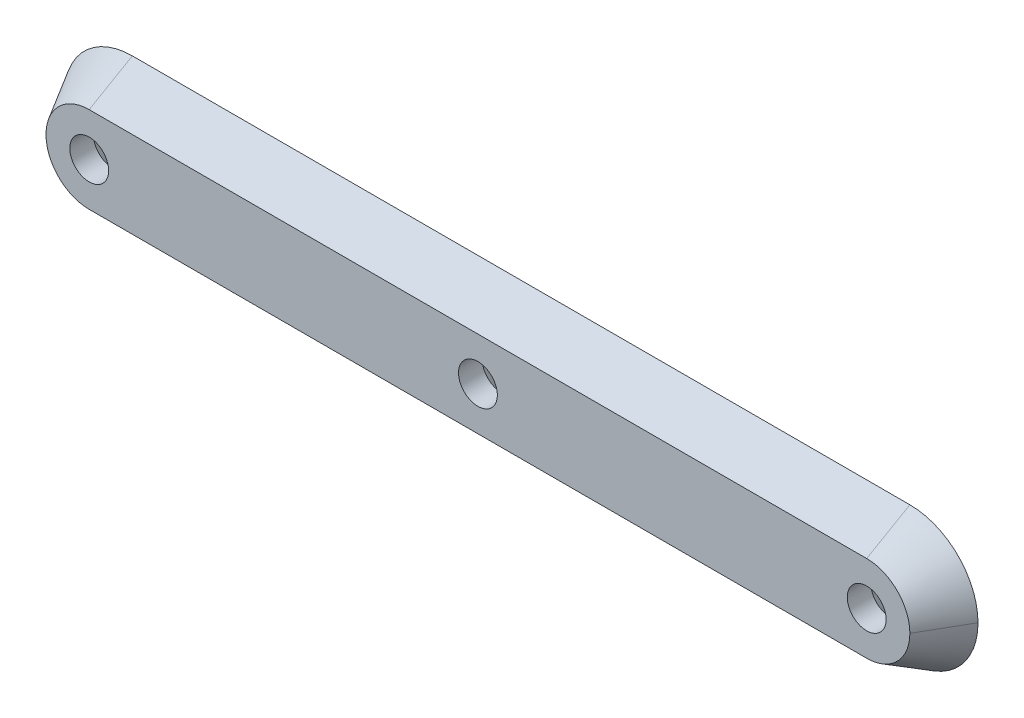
ISO-10303-21;
HEADER;
FILE_DESCRIPTION(('STEP AP214'),'2;1');
FILE_NAME('part.step','',(''),(''),'','','');
FILE_SCHEMA(('AUTOMOTIVE_DESIGN { 1 0 10303 214 1 1 1 1 }'));
ENDSEC;
DATA;
#1=APPLICATION_CONTEXT('core data for automotive mechanical design processes');
#2=APPLICATION_PROTOCOL_DEFINITION('international standard','automotive_design',2000,#1);
#3=PRODUCT_CONTEXT('',#1,'mechanical');
#4=PRODUCT('Part','Part','',(#3));
#5=PRODUCT_RELATED_PRODUCT_CATEGORY('part','',(#4));
#6=PRODUCT_DEFINITION_FORMATION('','',#4);
#7=PRODUCT_DEFINITION_CONTEXT('part definition',#1,'design');
#8=PRODUCT_DEFINITION('design','',#6,#7);
#9=PRODUCT_DEFINITION_SHAPE('','',#8);
#10=(LENGTH_UNIT() NAMED_UNIT(*) SI_UNIT(.MILLI.,.METRE.));
#11=(NAMED_UNIT(*) PLANE_ANGLE_UNIT() SI_UNIT($,.RADIAN.));
#12=(NAMED_UNIT(*) SI_UNIT($,.STERADIAN.) SOLID_ANGLE_UNIT());
#13=UNCERTAINTY_MEASURE_WITH_UNIT(LENGTH_MEASURE(1.E-05),#10,'distance_accuracy_value','');
#14=(GEOMETRIC_REPRESENTATION_CONTEXT(3) GLOBAL_UNCERTAINTY_ASSIGNED_CONTEXT((#13)) GLOBAL_UNIT_ASSIGNED_CONTEXT((#10,
#11,#12)) REPRESENTATION_CONTEXT('',''));
#15=CARTESIAN_POINT('',(0.,0.,0.));
#16=DIRECTION('',(0.,0.,1.));
#17=DIRECTION('',(1.,0.,0.));
#18=AXIS2_PLACEMENT_3D('',#15,#16,#17);
#19=CARTESIAN_POINT('',(50.0000000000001,-5.00000000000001,5.));
#20=DIRECTION('',(0.,-0.866025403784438,0.500000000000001));
#21=DIRECTION('',(0.,-0.500000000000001,-0.866025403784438));
#22=AXIS2_PLACEMENT_3D('',#19,#20,#21);
#23=PLANE('',#22);
#24=DIRECTION('',(-1.,0.,0.));
#25=VECTOR('',#24,1.);
#26=CARTESIAN_POINT('',(50.0000000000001,-7.88675134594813,0.));
#27=LINE('',#26,#25);
#28=CARTESIAN_POINT('',(-45.,-7.88675134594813,1.11022302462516E-13));
#29=VERTEX_POINT('',#28);
#30=CARTESIAN_POINT('',(45.0000000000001,-7.88675134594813,0.));
#31=VERTEX_POINT('',#30);
#32=EDGE_CURVE('E114',#29,#31,#27,.F.);
#33=ORIENTED_EDGE('',*,*,#32,.T.);
#34=DIRECTION('',(0.,-0.500000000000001,-0.866025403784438));
#35=VECTOR('',#34,1.);
#36=CARTESIAN_POINT('',(45.0000000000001,-5.00000000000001,5.));
#37=LINE('',#36,#35);
#38=CARTESIAN_POINT('',(45.0000000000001,-5.00000000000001,5.));
#39=VERTEX_POINT('',#38);
#40=EDGE_CURVE('E13',#31,#39,#37,.F.);
#41=ORIENTED_EDGE('',*,*,#40,.T.);
#42=DIRECTION('',(1.,0.,0.));
#43=VECTOR('',#42,1.);
#44=CARTESIAN_POINT('',(50.0000000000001,-5.00000000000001,5.));
#45=LINE('',#44,#43);
#46=CARTESIAN_POINT('',(-45.,-5.00000000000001,5.00000000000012));
#47=VERTEX_POINT('',#46);
#48=EDGE_CURVE('E113',#47,#39,#45,.T.);
#49=ORIENTED_EDGE('',*,*,#48,.F.);
#50=DIRECTION('',(0.,-0.500000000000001,-0.866025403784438));
#51=VECTOR('',#50,1.);
#52=CARTESIAN_POINT('',(-45.,-5.00000000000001,5.00000000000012));
#53=LINE('',#52,#51);
#54=EDGE_CURVE('E54',#47,#29,#53,.T.);
#55=ORIENTED_EDGE('',*,*,#54,.T.);
#56=EDGE_LOOP('',(#33,#41,#49,#55));
#57=FACE_BOUND('',#56,.T.);
#58=ADVANCED_FACE('F44',(#57),#23,.T.);
#59=CARTESIAN_POINT('',(50.0000000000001,5.,5.));
#60=DIRECTION('',(0.,0.866025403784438,0.500000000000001));
#61=DIRECTION('',(0.,-0.500000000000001,0.866025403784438));
#62=AXIS2_PLACEMENT_3D('',#59,#60,#61);
#63=PLANE('',#62);
#64=DIRECTION('',(-1.,0.,0.));
#65=VECTOR('',#64,1.);
#66=CARTESIAN_POINT('',(50.0000000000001,5.,5.));
#67=LINE('',#66,#65);
#68=CARTESIAN_POINT('',(45.0000000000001,5.00000000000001,5.));
#69=VERTEX_POINT('',#68);
#70=CARTESIAN_POINT('',(-45.,5.,5.00000000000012));
#71=VERTEX_POINT('',#70);
#72=EDGE_CURVE('E110',#69,#71,#67,.T.);
#73=ORIENTED_EDGE('',*,*,#72,.F.);
#74=DIRECTION('',(0.,0.500000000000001,-0.866025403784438));
#75=VECTOR('',#74,1.);
#76=CARTESIAN_POINT('',(45.0000000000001,5.00000000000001,5.));
#77=LINE('',#76,#75);
#78=CARTESIAN_POINT('',(45.0000000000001,7.88675134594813,0.));
#79=VERTEX_POINT('',#78);
#80=EDGE_CURVE('E98',#69,#79,#77,.T.);
#81=ORIENTED_EDGE('',*,*,#80,.T.);
#82=DIRECTION('',(1.,0.,0.));
#83=VECTOR('',#82,1.);
#84=CARTESIAN_POINT('',(50.0000000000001,7.88675134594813,0.));
#85=LINE('',#84,#83);
#86=CARTESIAN_POINT('',(-45.,7.88675134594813,1.11022302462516E-13));
#87=VERTEX_POINT('',#86);
#88=EDGE_CURVE('E107',#79,#87,#85,.F.);
#89=ORIENTED_EDGE('',*,*,#88,.T.);
#90=DIRECTION('',(0.,0.500000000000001,-0.866025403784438));
#91=VECTOR('',#90,1.);
#92=CARTESIAN_POINT('',(-45.,5.,5.00000000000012));
#93=LINE('',#92,#91);
#94=EDGE_CURVE('E48',#87,#71,#93,.F.);
#95=ORIENTED_EDGE('',*,*,#94,.T.);
#96=EDGE_LOOP('',(#73,#81,#89,#95));
#97=FACE_BOUND('',#96,.T.);
#98=ADVANCED_FACE('F46',(#97),#63,.T.);
#99=CARTESIAN_POINT('',(0.,0.,5.));
#100=DIRECTION('',(0.,0.,1.));
#101=DIRECTION('',(1.,0.,0.));
#102=AXIS2_PLACEMENT_3D('',#99,#100,#101);
#103=PLANE('',#102);
#104=CARTESIAN_POINT('',(-45.,0.,5.));
#105=DIRECTION('',(0.,0.,-1.));
#106=DIRECTION('',(-1.,0.,0.));
#107=AXIS2_PLACEMENT_3D('',#104,#105,#106);
#108=CIRCLE('',#107,2.2479);
#109=CARTESIAN_POINT('',(-47.2479,0.,5.));
#110=VERTEX_POINT('',#109);
#111=EDGE_CURVE('E157',#110,#110,#108,.T.);
#112=ORIENTED_EDGE('',*,*,#111,.T.);
#113=EDGE_LOOP('',(#112));
#114=FACE_BOUND('',#113,.T.);
#115=CARTESIAN_POINT('',(45.0000000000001,0.,4.99999999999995));
#116=DIRECTION('',(0.,0.,-1.));
#117=DIRECTION('',(-1.,0.,0.));
#118=AXIS2_PLACEMENT_3D('',#115,#116,#117);
#119=CIRCLE('',#118,2.2479);
#120=CARTESIAN_POINT('',(42.7521000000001,0.,4.99999999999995));
#121=VERTEX_POINT('',#120);
#122=EDGE_CURVE('E148',#121,#121,#119,.T.);
#123=ORIENTED_EDGE('',*,*,#122,.T.);
#124=EDGE_LOOP('',(#123));
#125=FACE_BOUND('',#124,.T.);
#126=CARTESIAN_POINT('',(0.,0.,5.));
#127=DIRECTION('',(0.,0.,-1.));
#128=DIRECTION('',(-1.,0.,0.));
#129=AXIS2_PLACEMENT_3D('',#126,#127,#128);
#130=CIRCLE('',#129,2.2479);
#131=CARTESIAN_POINT('',(-2.24789999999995,0.,5.));
#132=VERTEX_POINT('',#131);
#133=EDGE_CURVE('E127',#132,#132,#130,.T.);
#134=ORIENTED_EDGE('',*,*,#133,.T.);
#135=EDGE_LOOP('',(#134));
#136=FACE_BOUND('',#135,.T.);
#137=CARTESIAN_POINT('',(45.0000000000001,0.,4.99999999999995));
#138=DIRECTION('',(0.,0.,1.));
#139=DIRECTION('',(1.,0.,0.));
#140=AXIS2_PLACEMENT_3D('',#137,#138,#139);
#141=CIRCLE('',#140,5.);
#142=CARTESIAN_POINT('',(50.0000000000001,0.,5.));
#143=VERTEX_POINT('',#142);
#144=EDGE_CURVE('E62',#39,#143,#141,.T.);
#145=ORIENTED_EDGE('',*,*,#144,.T.);
#146=CARTESIAN_POINT('',(45.0000000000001,0.,4.99999999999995));
#147=DIRECTION('',(0.,0.,1.));
#148=DIRECTION('',(1.,0.,0.));
#149=AXIS2_PLACEMENT_3D('',#146,#147,#148);
#150=CIRCLE('',#149,5.);
#151=EDGE_CURVE('E129',#143,#69,#150,.T.);
#152=ORIENTED_EDGE('',*,*,#151,.T.);
#153=ORIENTED_EDGE('',*,*,#72,.T.);
#154=CARTESIAN_POINT('',(-45.,0.,5.));
#155=DIRECTION('',(0.,0.,1.));
#156=DIRECTION('',(1.,0.,0.));
#157=AXIS2_PLACEMENT_3D('',#154,#155,#156);
#158=CIRCLE('',#157,5.);
#159=CARTESIAN_POINT('',(-50.,0.,5.));
#160=VERTEX_POINT('',#159);
#161=EDGE_CURVE('E101',#71,#160,#158,.T.);
#162=ORIENTED_EDGE('',*,*,#161,.T.);
#163=CARTESIAN_POINT('',(-45.,0.,5.));
#164=DIRECTION('',(0.,0.,1.));
#165=DIRECTION('',(1.,0.,0.));
#166=AXIS2_PLACEMENT_3D('',#163,#164,#165);
#167=CIRCLE('',#166,5.);
#168=EDGE_CURVE('E134',#160,#47,#167,.T.);
#169=ORIENTED_EDGE('',*,*,#168,.T.);
#170=ORIENTED_EDGE('',*,*,#48,.T.);
#171=EDGE_LOOP('',(#145,#152,#153,#162,#169,#170));
#172=FACE_BOUND('',#171,.T.);
#173=ADVANCED_FACE('F172',(#114,#125,#136,#172),#103,.T.);
#174=CARTESIAN_POINT('',(0.,0.,0.));
#175=DIRECTION('',(0.,0.,1.));
#176=DIRECTION('',(1.,0.,0.));
#177=AXIS2_PLACEMENT_3D('',#174,#175,#176);
#178=PLANE('',#177);
#179=CARTESIAN_POINT('',(-45.,0.,0.));
#180=DIRECTION('',(0.,0.,-1.));
#181=DIRECTION('',(-1.,0.,0.));
#182=AXIS2_PLACEMENT_3D('',#179,#180,#181);
#183=CIRCLE('',#182,4.2164);
#184=CARTESIAN_POINT('',(-49.2164,0.,0.));
#185=VERTEX_POINT('',#184);
#186=EDGE_CURVE('E163',#185,#185,#183,.T.);
#187=ORIENTED_EDGE('',*,*,#186,.F.);
#188=EDGE_LOOP('',(#187));
#189=FACE_BOUND('',#188,.T.);
#190=CARTESIAN_POINT('',(45.0000000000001,0.,0.));
#191=DIRECTION('',(0.,0.,-1.));
#192=DIRECTION('',(-1.,0.,0.));
#193=AXIS2_PLACEMENT_3D('',#190,#191,#192);
#194=CIRCLE('',#193,4.2164);
#195=CARTESIAN_POINT('',(40.7836000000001,0.,0.));
#196=VERTEX_POINT('',#195);
#197=EDGE_CURVE('E154',#196,#196,#194,.T.);
#198=ORIENTED_EDGE('',*,*,#197,.F.);
#199=EDGE_LOOP('',(#198));
#200=FACE_BOUND('',#199,.T.);
#201=CARTESIAN_POINT('',(0.,0.,0.));
#202=DIRECTION('',(0.,0.,-1.));
#203=DIRECTION('',(-1.,0.,0.));
#204=AXIS2_PLACEMENT_3D('',#201,#202,#203);
#205=CIRCLE('',#204,4.2164);
#206=CARTESIAN_POINT('',(-4.2164,0.,0.));
#207=VERTEX_POINT('',#206);
#208=EDGE_CURVE('E145',#207,#207,#205,.T.);
#209=ORIENTED_EDGE('',*,*,#208,.F.);
#210=EDGE_LOOP('',(#209));
#211=FACE_BOUND('',#210,.T.);
#212=ORIENTED_EDGE('',*,*,#88,.F.);
#213=CARTESIAN_POINT('',(45.0000000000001,0.,0.));
#214=DIRECTION('',(0.,0.,1.));
#215=DIRECTION('',(1.,0.,0.));
#216=AXIS2_PLACEMENT_3D('',#213,#214,#215);
#217=CIRCLE('',#216,7.88675134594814);
#218=CARTESIAN_POINT('',(52.8867513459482,0.,0.));
#219=VERTEX_POINT('',#218);
#220=EDGE_CURVE('E94',#79,#219,#217,.F.);
#221=ORIENTED_EDGE('',*,*,#220,.T.);
#222=CARTESIAN_POINT('',(45.0000000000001,0.,0.));
#223=DIRECTION('',(0.,0.,1.));
#224=DIRECTION('',(1.,0.,0.));
#225=AXIS2_PLACEMENT_3D('',#222,#223,#224);
#226=CIRCLE('',#225,7.88675134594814);
#227=EDGE_CURVE('E102',#219,#31,#226,.F.);
#228=ORIENTED_EDGE('',*,*,#227,.T.);
#229=ORIENTED_EDGE('',*,*,#32,.F.);
#230=CARTESIAN_POINT('',(-45.,0.,0.));
#231=DIRECTION('',(0.,0.,1.));
#232=DIRECTION('',(1.,0.,0.));
#233=AXIS2_PLACEMENT_3D('',#230,#231,#232);
#234=CIRCLE('',#233,7.88675134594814);
#235=CARTESIAN_POINT('',(-52.8867513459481,0.,0.));
#236=VERTEX_POINT('',#235);
#237=EDGE_CURVE('E121',#29,#236,#234,.F.);
#238=ORIENTED_EDGE('',*,*,#237,.T.);
#239=CARTESIAN_POINT('',(-45.,0.,0.));
#240=DIRECTION('',(0.,0.,1.));
#241=DIRECTION('',(1.,0.,0.));
#242=AXIS2_PLACEMENT_3D('',#239,#240,#241);
#243=CIRCLE('',#242,7.88675134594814);
#244=EDGE_CURVE('E87',#236,#87,#243,.F.);
#245=ORIENTED_EDGE('',*,*,#244,.T.);
#246=EDGE_LOOP('',(#212,#221,#228,#229,#238,#245));
#247=FACE_BOUND('',#246,.T.);
#248=ADVANCED_FACE('F112',(#189,#200,#211,#247),#178,.F.);
#249=CARTESIAN_POINT('',(45.0000000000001,0.,4.99999999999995));
#250=DIRECTION('',(0.,0.,-1.));
#251=DIRECTION('',(1.,0.,0.));
#252=AXIS2_PLACEMENT_3D('',#249,#250,#251);
#253=CONICAL_SURFACE('',#252,5.,0.5235987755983);
#254=DIRECTION('',(0.500000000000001,0.,-0.866025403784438));
#255=VECTOR('',#254,1.);
#256=CARTESIAN_POINT('',(50.0000000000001,0.,5.));
#257=LINE('',#256,#255);
#258=EDGE_CURVE('E99',#143,#219,#257,.T.);
#259=ORIENTED_EDGE('',*,*,#258,.F.);
#260=ORIENTED_EDGE('',*,*,#144,.F.);
#261=ORIENTED_EDGE('',*,*,#40,.F.);
#262=ORIENTED_EDGE('',*,*,#227,.F.);
#263=EDGE_LOOP('',(#259,#260,#261,#262));
#264=FACE_BOUND('',#263,.T.);
#265=ADVANCED_FACE('F171',(#264),#253,.T.);
#266=CARTESIAN_POINT('',(45.0000000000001,0.,4.99999999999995));
#267=DIRECTION('',(0.,0.,-1.));
#268=DIRECTION('',(1.,0.,0.));
#269=AXIS2_PLACEMENT_3D('',#266,#267,#268);
#270=CONICAL_SURFACE('',#269,5.,0.5235987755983);
#271=ORIENTED_EDGE('',*,*,#151,.F.);
#272=ORIENTED_EDGE('',*,*,#258,.T.);
#273=ORIENTED_EDGE('',*,*,#220,.F.);
#274=ORIENTED_EDGE('',*,*,#80,.F.);
#275=EDGE_LOOP('',(#271,#272,#273,#274));
#276=FACE_BOUND('',#275,.T.);
#277=ADVANCED_FACE('F97',(#276),#270,.T.);
#278=CARTESIAN_POINT('',(-45.,0.,5.));
#279=DIRECTION('',(0.,0.,-1.));
#280=DIRECTION('',(1.,0.,0.));
#281=AXIS2_PLACEMENT_3D('',#278,#279,#280);
#282=CONICAL_SURFACE('',#281,5.,0.5235987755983);
#283=DIRECTION('',(-0.500000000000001,0.,-0.866025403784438));
#284=VECTOR('',#283,1.);
#285=CARTESIAN_POINT('',(-50.,0.,5.));
#286=LINE('',#285,#284);
#287=EDGE_CURVE('E124',#160,#236,#286,.T.);
#288=ORIENTED_EDGE('',*,*,#287,.F.);
#289=ORIENTED_EDGE('',*,*,#161,.F.);
#290=ORIENTED_EDGE('',*,*,#94,.F.);
#291=ORIENTED_EDGE('',*,*,#244,.F.);
#292=EDGE_LOOP('',(#288,#289,#290,#291));
#293=FACE_BOUND('',#292,.T.);
#294=ADVANCED_FACE('F203',(#293),#282,.T.);
#295=CARTESIAN_POINT('',(-45.,0.,5.));
#296=DIRECTION('',(0.,0.,-1.));
#297=DIRECTION('',(1.,0.,0.));
#298=AXIS2_PLACEMENT_3D('',#295,#296,#297);
#299=CONICAL_SURFACE('',#298,5.,0.5235987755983);
#300=ORIENTED_EDGE('',*,*,#168,.F.);
#301=ORIENTED_EDGE('',*,*,#287,.T.);
#302=ORIENTED_EDGE('',*,*,#237,.F.);
#303=ORIENTED_EDGE('',*,*,#54,.F.);
#304=EDGE_LOOP('',(#300,#301,#302,#303));
#305=FACE_BOUND('',#304,.T.);
#306=ADVANCED_FACE('F191',(#305),#299,.T.);
#307=CARTESIAN_POINT('',(0.,0.,0.));
#308=DIRECTION('',(0.,0.,-1.));
#309=DIRECTION('',(-1.,0.,0.));
#310=AXIS2_PLACEMENT_3D('',#307,#308,#309);
#311=CYLINDRICAL_SURFACE('',#310,2.2479);
#312=ORIENTED_EDGE('',*,*,#133,.F.);
#313=EDGE_LOOP('',(#312));
#314=FACE_BOUND('',#313,.T.);
#315=CARTESIAN_POINT('',(0.,0.,2.26450020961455));
#316=DIRECTION('',(0.,0.,-1.));
#317=DIRECTION('',(-1.,0.,0.));
#318=AXIS2_PLACEMENT_3D('',#315,#316,#317);
#319=CIRCLE('',#318,2.2479);
#320=CARTESIAN_POINT('',(-2.24789999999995,0.,2.26450020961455));
#321=VERTEX_POINT('',#320);
#322=EDGE_CURVE('E142',#321,#321,#319,.T.);
#323=ORIENTED_EDGE('',*,*,#322,.T.);
#324=EDGE_LOOP('',(#323));
#325=FACE_BOUND('',#324,.T.);
#326=ADVANCED_FACE('F181',(#314,#325),#311,.F.);
#327=CARTESIAN_POINT('',(0.,0.,0.));
#328=DIRECTION('',(0.,0.,-1.));
#329=DIRECTION('',(-1.,0.,0.));
#330=AXIS2_PLACEMENT_3D('',#327,#328,#329);
#331=CONICAL_SURFACE('',#330,4.2164,0.715584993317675);
#332=ORIENTED_EDGE('',*,*,#322,.F.);
#333=EDGE_LOOP('',(#332));
#334=FACE_BOUND('',#333,.T.);
#335=ORIENTED_EDGE('',*,*,#208,.T.);
#336=EDGE_LOOP('',(#335));
#337=FACE_BOUND('',#336,.T.);
#338=ADVANCED_FACE('F178',(#334,#337),#331,.F.);
#339=CARTESIAN_POINT('',(45.0000000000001,0.,0.));
#340=DIRECTION('',(0.,0.,-1.));
#341=DIRECTION('',(-1.,0.,0.));
#342=AXIS2_PLACEMENT_3D('',#339,#340,#341);
#343=CYLINDRICAL_SURFACE('',#342,2.2479);
#344=ORIENTED_EDGE('',*,*,#122,.F.);
#345=EDGE_LOOP('',(#344));
#346=FACE_BOUND('',#345,.T.);
#347=CARTESIAN_POINT('',(45.0000000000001,0.,2.26450020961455));
#348=DIRECTION('',(0.,0.,-1.));
#349=DIRECTION('',(-1.,0.,0.));
#350=AXIS2_PLACEMENT_3D('',#347,#348,#349);
#351=CIRCLE('',#350,2.2479);
#352=CARTESIAN_POINT('',(42.7521000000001,0.,2.26450020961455));
#353=VERTEX_POINT('',#352);
#354=EDGE_CURVE('E151',#353,#353,#351,.T.);
#355=ORIENTED_EDGE('',*,*,#354,.T.);
#356=EDGE_LOOP('',(#355));
#357=FACE_BOUND('',#356,.T.);
#358=ADVANCED_FACE('F180',(#346,#357),#343,.F.);
#359=CARTESIAN_POINT('',(45.0000000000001,0.,0.));
#360=DIRECTION('',(0.,0.,-1.));
#361=DIRECTION('',(-1.,0.,0.));
#362=AXIS2_PLACEMENT_3D('',#359,#360,#361);
#363=CONICAL_SURFACE('',#362,4.2164,0.715584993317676);
#364=ORIENTED_EDGE('',*,*,#354,.F.);
#365=EDGE_LOOP('',(#364));
#366=FACE_BOUND('',#365,.T.);
#367=ORIENTED_EDGE('',*,*,#197,.T.);
#368=EDGE_LOOP('',(#367));
#369=FACE_BOUND('',#368,.T.);
#370=ADVANCED_FACE('F188',(#366,#369),#363,.F.);
#371=CARTESIAN_POINT('',(-45.,0.,0.));
#372=DIRECTION('',(0.,0.,-1.));
#373=DIRECTION('',(-1.,0.,0.));
#374=AXIS2_PLACEMENT_3D('',#371,#372,#373);
#375=CYLINDRICAL_SURFACE('',#374,2.2479);
#376=ORIENTED_EDGE('',*,*,#111,.F.);
#377=EDGE_LOOP('',(#376));
#378=FACE_BOUND('',#377,.T.);
#379=CARTESIAN_POINT('',(-45.,0.,2.26450020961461));
#380=DIRECTION('',(0.,0.,-1.));
#381=DIRECTION('',(-1.,0.,0.));
#382=AXIS2_PLACEMENT_3D('',#379,#380,#381);
#383=CIRCLE('',#382,2.2479);
#384=CARTESIAN_POINT('',(-47.2479,0.,2.26450020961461));
#385=VERTEX_POINT('',#384);
#386=EDGE_CURVE('E160',#385,#385,#383,.T.);
#387=ORIENTED_EDGE('',*,*,#386,.T.);
#388=EDGE_LOOP('',(#387));
#389=FACE_BOUND('',#388,.T.);
#390=ADVANCED_FACE('F228',(#378,#389),#375,.F.);
#391=CARTESIAN_POINT('',(-45.,0.,0.));
#392=DIRECTION('',(0.,0.,-1.));
#393=DIRECTION('',(-1.,0.,0.));
#394=AXIS2_PLACEMENT_3D('',#391,#392,#393);
#395=CONICAL_SURFACE('',#394,4.2164,0.715584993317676);
#396=ORIENTED_EDGE('',*,*,#386,.F.);
#397=EDGE_LOOP('',(#396));
#398=FACE_BOUND('',#397,.T.);
#399=ORIENTED_EDGE('',*,*,#186,.T.);
#400=EDGE_LOOP('',(#399));
#401=FACE_BOUND('',#400,.T.);
#402=ADVANCED_FACE('F167',(#398,#401),#395,.F.);
#403=CLOSED_SHELL('',(#58,#98,#173,#248,#265,#277,#294,#306,#326,#338,#358,#370,#390,#402));
#404=MANIFOLD_SOLID_BREP('B2',#403);
#405=ADVANCED_BREP_SHAPE_REPRESENTATION('',(#18,#404),#14);
#406=SHAPE_DEFINITION_REPRESENTATION(#9,#405);
ENDSEC;
END-ISO-10303-21;
